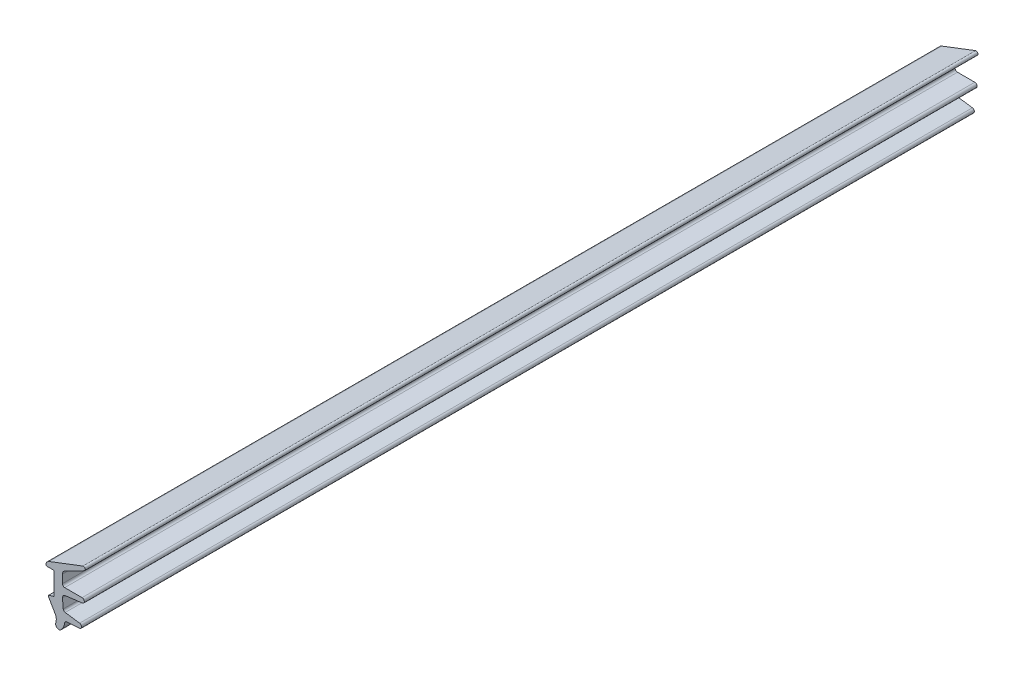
ISO-10303-21;
HEADER;
FILE_DESCRIPTION(('STEP AP214'),'2;1');
FILE_NAME('part.step','',(''),(''),'','','');
FILE_SCHEMA(('AUTOMOTIVE_DESIGN { 1 0 10303 214 1 1 1 1 }'));
ENDSEC;
DATA;
#1=APPLICATION_CONTEXT('core data for automotive mechanical design processes');
#2=APPLICATION_PROTOCOL_DEFINITION('international standard','automotive_design',2000,#1);
#3=PRODUCT_CONTEXT('',#1,'mechanical');
#4=PRODUCT('Part','Part','',(#3));
#5=PRODUCT_RELATED_PRODUCT_CATEGORY('part','',(#4));
#6=PRODUCT_DEFINITION_FORMATION('','',#4);
#7=PRODUCT_DEFINITION_CONTEXT('part definition',#1,'design');
#8=PRODUCT_DEFINITION('design','',#6,#7);
#9=PRODUCT_DEFINITION_SHAPE('','',#8);
#10=(LENGTH_UNIT() NAMED_UNIT(*) SI_UNIT(.MILLI.,.METRE.));
#11=(NAMED_UNIT(*) PLANE_ANGLE_UNIT() SI_UNIT($,.RADIAN.));
#12=(NAMED_UNIT(*) SI_UNIT($,.STERADIAN.) SOLID_ANGLE_UNIT());
#13=UNCERTAINTY_MEASURE_WITH_UNIT(LENGTH_MEASURE(1.E-05),#10,'distance_accuracy_value','');
#14=(GEOMETRIC_REPRESENTATION_CONTEXT(3) GLOBAL_UNCERTAINTY_ASSIGNED_CONTEXT((#13)) GLOBAL_UNIT_ASSIGNED_CONTEXT((#10,
#11,#12)) REPRESENTATION_CONTEXT('',''));
#15=CARTESIAN_POINT('',(0.,0.,0.));
#16=DIRECTION('',(0.,0.,1.));
#17=DIRECTION('',(1.,0.,0.));
#18=AXIS2_PLACEMENT_3D('',#15,#16,#17);
#19=CARTESIAN_POINT('',(-1.15176380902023,-5.26207958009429,0.));
#20=DIRECTION('',(-0.258819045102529,0.965925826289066,0.));
#21=DIRECTION('',(-0.965925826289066,-0.258819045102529,0.));
#22=AXIS2_PLACEMENT_3D('',#19,#20,#21);
#23=PLANE('',#22);
#24=DIRECTION('',(-0.965925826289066,-0.258819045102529,0.));
#25=VECTOR('',#24,1.);
#26=CARTESIAN_POINT('',(-1.15176380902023,-5.26207958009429,-97.75));
#27=LINE('',#26,#25);
#28=CARTESIAN_POINT('',(-0.148236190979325,-4.99318516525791,-97.75));
#29=VERTEX_POINT('',#28);
#30=CARTESIAN_POINT('',(-1.15176380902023,-5.2620795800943,-97.75));
#31=VERTEX_POINT('',#30);
#32=EDGE_CURVE('E214',#29,#31,#27,.T.);
#33=ORIENTED_EDGE('',*,*,#32,.T.);
#34=DIRECTION('',(0.,0.,1.));
#35=VECTOR('',#34,1.);
#36=CARTESIAN_POINT('',(-1.15176380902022,-5.26207958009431,0.));
#37=LINE('',#36,#35);
#38=CARTESIAN_POINT('',(-1.15176380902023,-5.2620795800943,97.75));
#39=VERTEX_POINT('',#38);
#40=EDGE_CURVE('E351',#39,#31,#37,.F.);
#41=ORIENTED_EDGE('',*,*,#40,.F.);
#42=DIRECTION('',(-0.965925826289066,-0.258819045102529,0.));
#43=VECTOR('',#42,1.);
#44=CARTESIAN_POINT('',(-1.15176380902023,-5.26207958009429,97.75));
#45=LINE('',#44,#43);
#46=CARTESIAN_POINT('',(-0.148236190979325,-4.99318516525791,97.75));
#47=VERTEX_POINT('',#46);
#48=EDGE_CURVE('E357',#39,#47,#45,.F.);
#49=ORIENTED_EDGE('',*,*,#48,.T.);
#50=DIRECTION('',(0.,0.,1.));
#51=VECTOR('',#50,1.);
#52=CARTESIAN_POINT('',(-0.148236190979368,-4.99318516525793,0.));
#53=LINE('',#52,#51);
#54=EDGE_CURVE('E359',#47,#29,#53,.F.);
#55=ORIENTED_EDGE('',*,*,#54,.T.);
#56=EDGE_LOOP('',(#33,#41,#49,#55));
#57=FACE_BOUND('',#56,.T.);
#58=ADVANCED_FACE('F15',(#57),#23,.T.);
#59=CARTESIAN_POINT('',(-0.19999999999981,-0.200000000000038,0.));
#60=DIRECTION('',(0.,0.,1.));
#61=DIRECTION('',(1.,0.,0.));
#62=AXIS2_PLACEMENT_3D('',#59,#60,#61);
#63=CYLINDRICAL_SURFACE('',#62,0.199999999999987);
#64=DIRECTION('',(0.,0.,-1.));
#65=VECTOR('',#64,1.);
#66=CARTESIAN_POINT('',(-0.19999999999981,0.,0.));
#67=LINE('',#66,#65);
#68=CARTESIAN_POINT('',(-0.19999999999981,0.,-97.75));
#69=VERTEX_POINT('',#68);
#70=CARTESIAN_POINT('',(-0.19999999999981,0.,97.75));
#71=VERTEX_POINT('',#70);
#72=EDGE_CURVE('E210',#69,#71,#67,.F.);
#73=ORIENTED_EDGE('',*,*,#72,.F.);
#74=CARTESIAN_POINT('',(-0.19999999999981,-0.200000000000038,-97.75));
#75=DIRECTION('',(0.,0.,1.));
#76=DIRECTION('',(1.,0.,0.));
#77=AXIS2_PLACEMENT_3D('',#74,#75,#76);
#78=CIRCLE('',#77,0.199999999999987);
#79=CARTESIAN_POINT('',(1.95047970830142E-13,-0.200000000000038,-97.75));
#80=VERTEX_POINT('',#79);
#81=EDGE_CURVE('E18',#80,#69,#78,.T.);
#82=ORIENTED_EDGE('',*,*,#81,.F.);
#83=DIRECTION('',(0.,0.,1.));
#84=VECTOR('',#83,1.);
#85=CARTESIAN_POINT('',(2.036238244E-13,-0.200000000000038,0.));
#86=LINE('',#85,#84);
#87=CARTESIAN_POINT('',(1.95047970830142E-13,-0.200000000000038,97.75));
#88=VERTEX_POINT('',#87);
#89=EDGE_CURVE('E207',#88,#80,#86,.F.);
#90=ORIENTED_EDGE('',*,*,#89,.F.);
#91=CARTESIAN_POINT('',(-0.19999999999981,-0.200000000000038,97.75));
#92=DIRECTION('',(0.,0.,1.));
#93=DIRECTION('',(1.,0.,0.));
#94=AXIS2_PLACEMENT_3D('',#91,#92,#93);
#95=CIRCLE('',#94,0.199999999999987);
#96=EDGE_CURVE('E213',#71,#88,#95,.F.);
#97=ORIENTED_EDGE('',*,*,#96,.F.);
#98=EDGE_LOOP('',(#73,#82,#90,#97));
#99=FACE_BOUND('',#98,.T.);
#100=ADVANCED_FACE('F205',(#99),#63,.F.);
#101=CARTESIAN_POINT('',(-0.199999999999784,-4.80000000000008,0.));
#102=DIRECTION('',(0.,0.,1.));
#103=DIRECTION('',(1.,0.,0.));
#104=AXIS2_PLACEMENT_3D('',#101,#102,#103);
#105=CYLINDRICAL_SURFACE('',#104,0.200000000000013);
#106=DIRECTION('',(0.,0.,1.));
#107=VECTOR('',#106,1.);
#108=CARTESIAN_POINT('',(2.036238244E-13,-4.80000000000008,0.));
#109=LINE('',#108,#107);
#110=CARTESIAN_POINT('',(1.95047970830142E-13,-4.80000000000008,-97.75));
#111=VERTEX_POINT('',#110);
#112=CARTESIAN_POINT('',(1.95047970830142E-13,-4.80000000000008,97.75));
#113=VERTEX_POINT('',#112);
#114=EDGE_CURVE('E222',#111,#113,#109,.T.);
#115=ORIENTED_EDGE('',*,*,#114,.F.);
#116=CARTESIAN_POINT('',(-0.199999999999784,-4.80000000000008,-97.75));
#117=DIRECTION('',(0.,0.,1.));
#118=DIRECTION('',(1.,0.,0.));
#119=AXIS2_PLACEMENT_3D('',#116,#117,#118);
#120=CIRCLE('',#119,0.200000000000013);
#121=EDGE_CURVE('E226',#29,#111,#120,.T.);
#122=ORIENTED_EDGE('',*,*,#121,.F.);
#123=ORIENTED_EDGE('',*,*,#54,.F.);
#124=CARTESIAN_POINT('',(-0.199999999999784,-4.80000000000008,97.75));
#125=DIRECTION('',(0.,0.,1.));
#126=DIRECTION('',(1.,0.,0.));
#127=AXIS2_PLACEMENT_3D('',#124,#125,#126);
#128=CIRCLE('',#127,0.200000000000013);
#129=EDGE_CURVE('E417',#113,#47,#128,.F.);
#130=ORIENTED_EDGE('',*,*,#129,.F.);
#131=EDGE_LOOP('',(#115,#122,#123,#130));
#132=FACE_BOUND('',#131,.T.);
#133=ADVANCED_FACE('F502',(#132),#105,.F.);
#134=CARTESIAN_POINT('',(-1.09999999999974,-5.45526474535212,0.));
#135=DIRECTION('',(0.,0.,1.));
#136=DIRECTION('',(1.,0.,0.));
#137=AXIS2_PLACEMENT_3D('',#134,#135,#136);
#138=CYLINDRICAL_SURFACE('',#137,0.199999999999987);
#139=CARTESIAN_POINT('',(-1.09999999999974,-5.45526474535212,-97.75));
#140=DIRECTION('',(0.,0.,1.));
#141=DIRECTION('',(1.,0.,0.));
#142=AXIS2_PLACEMENT_3D('',#139,#140,#141);
#143=CIRCLE('',#142,0.199999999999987);
#144=CARTESIAN_POINT('',(-1.27320508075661,-5.55526474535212,-97.75));
#145=VERTEX_POINT('',#144);
#146=EDGE_CURVE('E354',#31,#145,#143,.T.);
#147=ORIENTED_EDGE('',*,*,#146,.T.);
#148=DIRECTION('',(0.,0.,1.));
#149=VECTOR('',#148,1.);
#150=CARTESIAN_POINT('',(-1.27320508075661,-5.55526474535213,0.));
#151=LINE('',#150,#149);
#152=CARTESIAN_POINT('',(-1.27320508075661,-5.55526474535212,97.75));
#153=VERTEX_POINT('',#152);
#154=EDGE_CURVE('E329',#153,#145,#151,.F.);
#155=ORIENTED_EDGE('',*,*,#154,.F.);
#156=CARTESIAN_POINT('',(-1.09999999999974,-5.45526474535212,97.75));
#157=DIRECTION('',(0.,0.,1.));
#158=DIRECTION('',(1.,0.,0.));
#159=AXIS2_PLACEMENT_3D('',#156,#157,#158);
#160=CIRCLE('',#159,0.199999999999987);
#161=EDGE_CURVE('E355',#153,#39,#160,.F.);
#162=ORIENTED_EDGE('',*,*,#161,.T.);
#163=ORIENTED_EDGE('',*,*,#40,.T.);
#164=EDGE_LOOP('',(#147,#155,#162,#163));
#165=FACE_BOUND('',#164,.T.);
#166=ADVANCED_FACE('F497',(#165),#138,.T.);
#167=CARTESIAN_POINT('',(-1.54837324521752,-9.07865950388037,0.));
#168=DIRECTION('',(0.,0.,1.));
#169=DIRECTION('',(1.,0.,0.));
#170=AXIS2_PLACEMENT_3D('',#167,#168,#169);
#171=CYLINDRICAL_SURFACE('',#170,2.);
#172=DIRECTION('',(0.,0.,1.));
#173=VECTOR('',#172,1.);
#174=CARTESIAN_POINT('',(0.183677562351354,-8.07865950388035,0.));
#175=LINE('',#174,#173);
#176=CARTESIAN_POINT('',(0.183677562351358,-8.07865950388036,-97.75));
#177=VERTEX_POINT('',#176);
#178=CARTESIAN_POINT('',(0.183677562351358,-8.07865950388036,97.75));
#179=VERTEX_POINT('',#178);
#180=EDGE_CURVE('E328',#177,#179,#175,.T.);
#181=ORIENTED_EDGE('',*,*,#180,.F.);
#182=CARTESIAN_POINT('',(-1.54837324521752,-9.07865950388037,-97.75));
#183=DIRECTION('',(0.,0.,1.));
#184=DIRECTION('',(1.,0.,0.));
#185=AXIS2_PLACEMENT_3D('',#182,#183,#184);
#186=CIRCLE('',#185,2.);
#187=CARTESIAN_POINT('',(0.383478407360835,-9.59629759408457,-97.7500000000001));
#188=VERTEX_POINT('',#187);
#189=EDGE_CURVE('E412',#188,#177,#186,.T.);
#190=ORIENTED_EDGE('',*,*,#189,.F.);
#191=DIRECTION('',(0.,0.,1.));
#192=VECTOR('',#191,1.);
#193=CARTESIAN_POINT('',(0.383478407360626,-9.59629759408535,0.));
#194=LINE('',#193,#192);
#195=CARTESIAN_POINT('',(0.383478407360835,-9.59629759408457,97.75));
#196=VERTEX_POINT('',#195);
#197=EDGE_CURVE('E343',#196,#188,#194,.F.);
#198=ORIENTED_EDGE('',*,*,#197,.F.);
#199=CARTESIAN_POINT('',(-1.54837324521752,-9.07865950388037,97.75));
#200=DIRECTION('',(0.,0.,1.));
#201=DIRECTION('',(1.,0.,0.));
#202=AXIS2_PLACEMENT_3D('',#199,#200,#201);
#203=CIRCLE('',#202,2.);
#204=EDGE_CURVE('E344',#179,#196,#203,.F.);
#205=ORIENTED_EDGE('',*,*,#204,.F.);
#206=EDGE_LOOP('',(#181,#190,#198,#205));
#207=FACE_BOUND('',#206,.T.);
#208=ADVANCED_FACE('F489',(#207),#171,.F.);
#209=CARTESIAN_POINT('',(0.323851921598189,-9.81882666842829,0.));
#210=DIRECTION('',(-0.965925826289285,0.258819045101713,0.));
#211=DIRECTION('',(-0.258819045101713,-0.965925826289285,0.));
#212=AXIS2_PLACEMENT_3D('',#209,#210,#211);
#213=PLANE('',#212);
#214=DIRECTION('',(-0.258819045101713,-0.965925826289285,0.));
#215=VECTOR('',#214,1.);
#216=CARTESIAN_POINT('',(0.323851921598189,-9.81882666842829,-97.7500000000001));
#217=LINE('',#216,#215);
#218=CARTESIAN_POINT('',(0.323851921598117,-9.81882666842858,-97.75));
#219=VERTEX_POINT('',#218);
#220=EDGE_CURVE('E345',#188,#219,#217,.T.);
#221=ORIENTED_EDGE('',*,*,#220,.T.);
#222=DIRECTION('',(0.,0.,1.));
#223=VECTOR('',#222,1.);
#224=CARTESIAN_POINT('',(0.323851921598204,-9.8188266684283,0.));
#225=LINE('',#224,#223);
#226=CARTESIAN_POINT('',(0.323851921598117,-9.81882666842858,97.75));
#227=VERTEX_POINT('',#226);
#228=EDGE_CURVE('E323',#227,#219,#225,.F.);
#229=ORIENTED_EDGE('',*,*,#228,.F.);
#230=DIRECTION('',(-0.258819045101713,-0.965925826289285,0.));
#231=VECTOR('',#230,1.);
#232=CARTESIAN_POINT('',(0.323851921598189,-9.81882666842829,97.7500000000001));
#233=LINE('',#232,#231);
#234=EDGE_CURVE('E340',#227,#196,#233,.F.);
#235=ORIENTED_EDGE('',*,*,#234,.T.);
#236=ORIENTED_EDGE('',*,*,#197,.T.);
#237=EDGE_LOOP('',(#221,#229,#235,#236));
#238=FACE_BOUND('',#237,.T.);
#239=ADVANCED_FACE('F485',(#238),#213,.T.);
#240=CARTESIAN_POINT('',(2.77918139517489,-8.86828108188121,0.));
#241=DIRECTION('',(0.,0.,1.));
#242=DIRECTION('',(1.,0.,0.));
#243=AXIS2_PLACEMENT_3D('',#240,#241,#242);
#244=CYLINDRICAL_SURFACE('',#243,0.500000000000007);
#245=DIRECTION('',(0.,0.,1.));
#246=VECTOR('',#245,1.);
#247=CARTESIAN_POINT('',(2.28240305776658,-8.81161289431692,0.));
#248=LINE('',#247,#246);
#249=CARTESIAN_POINT('',(2.28240305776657,-8.81161289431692,-97.75));
#250=VERTEX_POINT('',#249);
#251=CARTESIAN_POINT('',(2.28240305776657,-8.81161289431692,97.75));
#252=VERTEX_POINT('',#251);
#253=EDGE_CURVE('E317',#250,#252,#248,.T.);
#254=ORIENTED_EDGE('',*,*,#253,.F.);
#255=CARTESIAN_POINT('',(2.77918139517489,-8.86828108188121,-97.75));
#256=DIRECTION('',(0.,0.,1.));
#257=DIRECTION('',(1.,0.,0.));
#258=AXIS2_PLACEMENT_3D('',#255,#256,#257);
#259=CIRCLE('',#258,0.500000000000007);
#260=CARTESIAN_POINT('',(2.74865712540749,-8.36921368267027,-97.75));
#261=VERTEX_POINT('',#260);
#262=EDGE_CURVE('E347',#261,#250,#259,.T.);
#263=ORIENTED_EDGE('',*,*,#262,.F.);
#264=DIRECTION('',(0.,0.,1.));
#265=VECTOR('',#264,1.);
#266=CARTESIAN_POINT('',(2.7486571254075,-8.36921368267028,0.));
#267=LINE('',#266,#265);
#268=CARTESIAN_POINT('',(2.74865712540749,-8.36921368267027,97.75));
#269=VERTEX_POINT('',#268);
#270=EDGE_CURVE('E314',#269,#261,#267,.F.);
#271=ORIENTED_EDGE('',*,*,#270,.F.);
#272=CARTESIAN_POINT('',(2.77918139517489,-8.86828108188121,97.75));
#273=DIRECTION('',(0.,0.,1.));
#274=DIRECTION('',(1.,0.,0.));
#275=AXIS2_PLACEMENT_3D('',#272,#273,#274);
#276=CIRCLE('',#275,0.500000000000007);
#277=EDGE_CURVE('E408',#252,#269,#276,.F.);
#278=ORIENTED_EDGE('',*,*,#277,.F.);
#279=EDGE_LOOP('',(#254,#263,#271,#278));
#280=FACE_BOUND('',#279,.T.);
#281=ADVANCED_FACE('F475',(#280),#244,.F.);
#282=CARTESIAN_POINT('',(5.5000000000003,-7.69999999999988,0.));
#283=DIRECTION('',(0.,0.,1.));
#284=DIRECTION('',(1.,0.,0.));
#285=AXIS2_PLACEMENT_3D('',#282,#283,#284);
#286=CYLINDRICAL_SURFACE('',#285,0.500000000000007);
#287=CARTESIAN_POINT('',(5.5000000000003,-7.69999999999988,-97.75));
#288=DIRECTION('',(0.,0.,1.));
#289=DIRECTION('',(1.,0.,0.));
#290=AXIS2_PLACEMENT_3D('',#287,#288,#289);
#291=CIRCLE('',#290,0.500000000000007);
#292=CARTESIAN_POINT('',(5.53052426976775,-8.19906739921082,-97.75));
#293=VERTEX_POINT('',#292);
#294=CARTESIAN_POINT('',(5.56958655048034,-7.20486596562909,-97.75));
#295=VERTEX_POINT('',#294);
#296=EDGE_CURVE('E404',#293,#295,#291,.T.);
#297=ORIENTED_EDGE('',*,*,#296,.T.);
#298=DIRECTION('',(0.,0.,1.));
#299=VECTOR('',#298,1.);
#300=CARTESIAN_POINT('',(5.56958655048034,-7.2048659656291,0.));
#301=LINE('',#300,#299);
#302=CARTESIAN_POINT('',(5.56958655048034,-7.20486596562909,97.75));
#303=VERTEX_POINT('',#302);
#304=EDGE_CURVE('E308',#303,#295,#301,.F.);
#305=ORIENTED_EDGE('',*,*,#304,.F.);
#306=CARTESIAN_POINT('',(5.5000000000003,-7.69999999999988,97.75));
#307=DIRECTION('',(0.,0.,1.));
#308=DIRECTION('',(1.,0.,0.));
#309=AXIS2_PLACEMENT_3D('',#306,#307,#308);
#310=CIRCLE('',#309,0.500000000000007);
#311=CARTESIAN_POINT('',(5.53052426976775,-8.19906739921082,97.75));
#312=VERTEX_POINT('',#311);
#313=EDGE_CURVE('E406',#303,#312,#310,.F.);
#314=ORIENTED_EDGE('',*,*,#313,.T.);
#315=DIRECTION('',(0.,0.,1.));
#316=VECTOR('',#315,1.);
#317=CARTESIAN_POINT('',(5.53052426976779,-8.19906739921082,0.));
#318=LINE('',#317,#316);
#319=EDGE_CURVE('E311',#293,#312,#318,.T.);
#320=ORIENTED_EDGE('',*,*,#319,.F.);
#321=EDGE_LOOP('',(#297,#305,#314,#320));
#322=FACE_BOUND('',#321,.T.);
#323=ADVANCED_FACE('F471',(#322),#286,.T.);
#324=CARTESIAN_POINT('',(2.47544367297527,-6.26509875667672,0.));
#325=DIRECTION('',(0.,0.,1.));
#326=DIRECTION('',(1.,0.,0.));
#327=AXIS2_PLACEMENT_3D('',#324,#325,#326);
#328=CYLINDRICAL_SURFACE('',#327,0.500000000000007);
#329=DIRECTION('',(0.,0.,1.));
#330=VECTOR('',#329,1.);
#331=CARTESIAN_POINT('',(2.40585712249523,-6.76023279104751,0.));
#332=LINE('',#331,#330);
#333=CARTESIAN_POINT('',(2.40585712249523,-6.76023279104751,-97.75));
#334=VERTEX_POINT('',#333);
#335=CARTESIAN_POINT('',(2.40585712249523,-6.76023279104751,97.75));
#336=VERTEX_POINT('',#335);
#337=EDGE_CURVE('E305',#334,#336,#332,.T.);
#338=ORIENTED_EDGE('',*,*,#337,.F.);
#339=CARTESIAN_POINT('',(2.47544367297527,-6.26509875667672,-97.75));
#340=DIRECTION('',(0.,0.,1.));
#341=DIRECTION('',(1.,0.,0.));
#342=AXIS2_PLACEMENT_3D('',#339,#340,#341);
#343=CIRCLE('',#342,0.500000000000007);
#344=CARTESIAN_POINT('',(1.9773463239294,-6.30867662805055,-97.75));
#345=VERTEX_POINT('',#344);
#346=EDGE_CURVE('E402',#345,#334,#343,.T.);
#347=ORIENTED_EDGE('',*,*,#346,.F.);
#348=DIRECTION('',(0.,0.,1.));
#349=VECTOR('',#348,1.);
#350=CARTESIAN_POINT('',(1.97734632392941,-6.30867662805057,0.));
#351=LINE('',#350,#349);
#352=CARTESIAN_POINT('',(1.9773463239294,-6.30867662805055,97.75));
#353=VERTEX_POINT('',#352);
#354=EDGE_CURVE('E302',#353,#345,#351,.F.);
#355=ORIENTED_EDGE('',*,*,#354,.F.);
#356=CARTESIAN_POINT('',(2.47544367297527,-6.26509875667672,97.75));
#357=DIRECTION('',(0.,0.,1.));
#358=DIRECTION('',(1.,0.,0.));
#359=AXIS2_PLACEMENT_3D('',#356,#357,#358);
#360=CIRCLE('',#359,0.500000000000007);
#361=EDGE_CURVE('E400',#336,#353,#360,.F.);
#362=ORIENTED_EDGE('',*,*,#361,.F.);
#363=EDGE_LOOP('',(#338,#347,#355,#362));
#364=FACE_BOUND('',#363,.T.);
#365=ADVANCED_FACE('F575',(#364),#328,.F.);
#366=CARTESIAN_POINT('',(2.50000000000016,-4.2510362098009,0.));
#367=DIRECTION('',(0.,0.,1.));
#368=DIRECTION('',(1.,0.,0.));
#369=AXIS2_PLACEMENT_3D('',#366,#367,#368);
#370=CYLINDRICAL_SURFACE('',#369,0.699999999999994);
#371=DIRECTION('',(0.,0.,1.));
#372=VECTOR('',#371,1.);
#373=CARTESIAN_POINT('',(1.80266371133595,-4.31204522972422,0.));
#374=LINE('',#373,#372);
#375=CARTESIAN_POINT('',(1.80266371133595,-4.31204522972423,-97.75));
#376=VERTEX_POINT('',#375);
#377=CARTESIAN_POINT('',(1.80266371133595,-4.31204522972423,97.75));
#378=VERTEX_POINT('',#377);
#379=EDGE_CURVE('E299',#376,#378,#374,.T.);
#380=ORIENTED_EDGE('',*,*,#379,.F.);
#381=CARTESIAN_POINT('',(2.50000000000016,-4.2510362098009,-97.75));
#382=DIRECTION('',(0.,0.,1.));
#383=DIRECTION('',(1.,0.,0.));
#384=AXIS2_PLACEMENT_3D('',#381,#382,#383);
#385=CIRCLE('',#384,0.699999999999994);
#386=CARTESIAN_POINT('',(2.41469145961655,-3.55625390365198,-97.75));
#387=VERTEX_POINT('',#386);
#388=EDGE_CURVE('E398',#387,#376,#385,.T.);
#389=ORIENTED_EDGE('',*,*,#388,.F.);
#390=DIRECTION('',(0.,0.,1.));
#391=VECTOR('',#390,1.);
#392=CARTESIAN_POINT('',(2.41469145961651,-3.55625390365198,0.));
#393=LINE('',#392,#391);
#394=CARTESIAN_POINT('',(2.41469145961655,-3.55625390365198,97.75));
#395=VERTEX_POINT('',#394);
#396=EDGE_CURVE('E296',#395,#387,#393,.F.);
#397=ORIENTED_EDGE('',*,*,#396,.F.);
#398=CARTESIAN_POINT('',(2.50000000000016,-4.2510362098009,97.75));
#399=DIRECTION('',(0.,0.,1.));
#400=DIRECTION('',(1.,0.,0.));
#401=AXIS2_PLACEMENT_3D('',#398,#399,#400);
#402=CIRCLE('',#401,0.699999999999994);
#403=EDGE_CURVE('E396',#378,#395,#402,.F.);
#404=ORIENTED_EDGE('',*,*,#403,.F.);
#405=EDGE_LOOP('',(#380,#389,#397,#404));
#406=FACE_BOUND('',#405,.T.);
#407=ADVANCED_FACE('F571',(#406),#370,.F.);
#408=CARTESIAN_POINT('',(6.10000000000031,-2.59999999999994,0.));
#409=DIRECTION('',(0.,0.,1.));
#410=DIRECTION('',(1.,0.,0.));
#411=AXIS2_PLACEMENT_3D('',#408,#409,#410);
#412=CYLINDRICAL_SURFACE('',#411,0.500000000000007);
#413=CARTESIAN_POINT('',(6.10000000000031,-2.59999999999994,-97.75));
#414=DIRECTION('',(0.,0.,1.));
#415=DIRECTION('',(1.,0.,0.));
#416=AXIS2_PLACEMENT_3D('',#413,#414,#415);
#417=CIRCLE('',#416,0.500000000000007);
#418=CARTESIAN_POINT('',(6.16093467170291,-3.09627307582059,-97.75));
#419=VERTEX_POINT('',#418);
#420=CARTESIAN_POINT('',(6.10000000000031,-2.09999999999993,-97.75));
#421=VERTEX_POINT('',#420);
#422=EDGE_CURVE('E392',#419,#421,#417,.T.);
#423=ORIENTED_EDGE('',*,*,#422,.T.);
#424=DIRECTION('',(0.,0.,1.));
#425=VECTOR('',#424,1.);
#426=CARTESIAN_POINT('',(6.10000000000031,-2.09999999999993,0.));
#427=LINE('',#426,#425);
#428=CARTESIAN_POINT('',(6.10000000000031,-2.09999999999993,97.75));
#429=VERTEX_POINT('',#428);
#430=EDGE_CURVE('E290',#429,#421,#427,.F.);
#431=ORIENTED_EDGE('',*,*,#430,.F.);
#432=CARTESIAN_POINT('',(6.10000000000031,-2.59999999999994,97.75));
#433=DIRECTION('',(0.,0.,1.));
#434=DIRECTION('',(1.,0.,0.));
#435=AXIS2_PLACEMENT_3D('',#432,#433,#434);
#436=CIRCLE('',#435,0.500000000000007);
#437=CARTESIAN_POINT('',(6.16093467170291,-3.09627307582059,97.75));
#438=VERTEX_POINT('',#437);
#439=EDGE_CURVE('E394',#429,#438,#436,.F.);
#440=ORIENTED_EDGE('',*,*,#439,.T.);
#441=DIRECTION('',(0.,0.,1.));
#442=VECTOR('',#441,1.);
#443=CARTESIAN_POINT('',(6.16093467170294,-3.09627307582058,0.));
#444=LINE('',#443,#442);
#445=EDGE_CURVE('E293',#419,#438,#444,.T.);
#446=ORIENTED_EDGE('',*,*,#445,.F.);
#447=EDGE_LOOP('',(#423,#431,#440,#446));
#448=FACE_BOUND('',#447,.T.);
#449=ADVANCED_FACE('F567',(#448),#412,.T.);
#450=CARTESIAN_POINT('',(2.30000000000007,-1.59999999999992,0.));
#451=DIRECTION('',(0.,0.,1.));
#452=DIRECTION('',(1.,0.,0.));
#453=AXIS2_PLACEMENT_3D('',#450,#451,#452);
#454=CYLINDRICAL_SURFACE('',#453,0.500000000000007);
#455=DIRECTION('',(0.,0.,1.));
#456=VECTOR('',#455,1.);
#457=CARTESIAN_POINT('',(2.30000000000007,-2.09999999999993,0.));
#458=LINE('',#457,#456);
#459=CARTESIAN_POINT('',(2.30000000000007,-2.09999999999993,-97.75));
#460=VERTEX_POINT('',#459);
#461=CARTESIAN_POINT('',(2.30000000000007,-2.09999999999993,97.75));
#462=VERTEX_POINT('',#461);
#463=EDGE_CURVE('E287',#460,#462,#458,.T.);
#464=ORIENTED_EDGE('',*,*,#463,.F.);
#465=CARTESIAN_POINT('',(2.30000000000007,-1.59999999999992,-97.75));
#466=DIRECTION('',(0.,0.,1.));
#467=DIRECTION('',(1.,0.,0.));
#468=AXIS2_PLACEMENT_3D('',#465,#466,#467);
#469=CIRCLE('',#468,0.500000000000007);
#470=CARTESIAN_POINT('',(1.80000000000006,-1.59999999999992,-97.75));
#471=VERTEX_POINT('',#470);
#472=EDGE_CURVE('E390',#471,#460,#469,.T.);
#473=ORIENTED_EDGE('',*,*,#472,.F.);
#474=DIRECTION('',(0.,0.,-1.));
#475=VECTOR('',#474,1.);
#476=CARTESIAN_POINT('',(1.80000000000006,-1.59999999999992,0.));
#477=LINE('',#476,#475);
#478=CARTESIAN_POINT('',(1.80000000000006,-1.59999999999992,97.75));
#479=VERTEX_POINT('',#478);
#480=EDGE_CURVE('E284',#479,#471,#477,.T.);
#481=ORIENTED_EDGE('',*,*,#480,.F.);
#482=CARTESIAN_POINT('',(2.30000000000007,-1.59999999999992,97.75));
#483=DIRECTION('',(0.,0.,1.));
#484=DIRECTION('',(1.,0.,0.));
#485=AXIS2_PLACEMENT_3D('',#482,#483,#484);
#486=CIRCLE('',#485,0.500000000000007);
#487=EDGE_CURVE('E388',#462,#479,#486,.F.);
#488=ORIENTED_EDGE('',*,*,#487,.F.);
#489=EDGE_LOOP('',(#464,#473,#481,#488));
#490=FACE_BOUND('',#489,.T.);
#491=ADVANCED_FACE('F563',(#490),#454,.F.);
#492=CARTESIAN_POINT('',(2.80000000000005,0.194451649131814,0.));
#493=DIRECTION('',(0.,0.,1.));
#494=DIRECTION('',(1.,0.,0.));
#495=AXIS2_PLACEMENT_3D('',#492,#493,#494);
#496=CYLINDRICAL_SURFACE('',#495,1.00000000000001);
#497=DIRECTION('',(0.,0.,-1.));
#498=VECTOR('',#497,1.);
#499=CARTESIAN_POINT('',(1.80000000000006,0.194451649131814,0.));
#500=LINE('',#499,#498);
#501=CARTESIAN_POINT('',(1.80000000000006,0.194451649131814,-97.75));
#502=VERTEX_POINT('',#501);
#503=CARTESIAN_POINT('',(1.80000000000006,0.194451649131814,97.75));
#504=VERTEX_POINT('',#503);
#505=EDGE_CURVE('E283',#502,#504,#500,.F.);
#506=ORIENTED_EDGE('',*,*,#505,.F.);
#507=CARTESIAN_POINT('',(2.80000000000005,0.194451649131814,-97.75));
#508=DIRECTION('',(0.,0.,1.));
#509=DIRECTION('',(1.,0.,0.));
#510=AXIS2_PLACEMENT_3D('',#507,#508,#509);
#511=CIRCLE('',#510,1.00000000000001);
#512=CARTESIAN_POINT('',(2.34600950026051,1.08545817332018,-97.75));
#513=VERTEX_POINT('',#512);
#514=EDGE_CURVE('E386',#513,#502,#511,.T.);
#515=ORIENTED_EDGE('',*,*,#514,.F.);
#516=DIRECTION('',(0.,0.,1.));
#517=VECTOR('',#516,1.);
#518=CARTESIAN_POINT('',(2.34600950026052,1.08545817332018,0.));
#519=LINE('',#518,#517);
#520=CARTESIAN_POINT('',(2.34600950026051,1.08545817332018,97.75));
#521=VERTEX_POINT('',#520);
#522=EDGE_CURVE('E279',#521,#513,#519,.F.);
#523=ORIENTED_EDGE('',*,*,#522,.F.);
#524=CARTESIAN_POINT('',(2.80000000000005,0.194451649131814,97.75));
#525=DIRECTION('',(0.,0.,1.));
#526=DIRECTION('',(1.,0.,0.));
#527=AXIS2_PLACEMENT_3D('',#524,#525,#526);
#528=CIRCLE('',#527,1.00000000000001);
#529=EDGE_CURVE('E339',#504,#521,#528,.F.);
#530=ORIENTED_EDGE('',*,*,#529,.F.);
#531=EDGE_LOOP('',(#506,#515,#523,#530));
#532=FACE_BOUND('',#531,.T.);
#533=ADVANCED_FACE('F560',(#532),#496,.F.);
#534=CARTESIAN_POINT('',(-0.19999999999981,0.,0.));
#535=DIRECTION('',(0.,-1.,0.));
#536=DIRECTION('',(0.,0.,-1.));
#537=AXIS2_PLACEMENT_3D('',#534,#535,#536);
#538=PLANE('',#537);
#539=DIRECTION('',(1.,0.,0.));
#540=VECTOR('',#539,1.);
#541=CARTESIAN_POINT('',(-0.19999999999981,0.,-97.75));
#542=LINE('',#541,#540);
#543=CARTESIAN_POINT('',(-1.59999999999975,0.,-97.75));
#544=VERTEX_POINT('',#543);
#545=EDGE_CURVE('E335',#544,#69,#542,.T.);
#546=ORIENTED_EDGE('',*,*,#545,.T.);
#547=ORIENTED_EDGE('',*,*,#72,.T.);
#548=DIRECTION('',(1.,0.,0.));
#549=VECTOR('',#548,1.);
#550=CARTESIAN_POINT('',(-0.19999999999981,0.,97.75));
#551=LINE('',#550,#549);
#552=CARTESIAN_POINT('',(-1.59999999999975,0.,97.75));
#553=VERTEX_POINT('',#552);
#554=EDGE_CURVE('E337',#71,#553,#551,.F.);
#555=ORIENTED_EDGE('',*,*,#554,.T.);
#556=DIRECTION('',(0.,0.,1.));
#557=VECTOR('',#556,1.);
#558=CARTESIAN_POINT('',(-1.59999999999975,0.,0.));
#559=LINE('',#558,#557);
#560=EDGE_CURVE('E277',#544,#553,#559,.T.);
#561=ORIENTED_EDGE('',*,*,#560,.F.);
#562=EDGE_LOOP('',(#546,#547,#555,#561));
#563=FACE_BOUND('',#562,.T.);
#564=ADVANCED_FACE('F423',(#563),#538,.T.);
#565=CARTESIAN_POINT('',(2.036238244E-13,-4.80000000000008,0.));
#566=DIRECTION('',(-1.,0.,0.));
#567=DIRECTION('',(0.,0.,1.));
#568=AXIS2_PLACEMENT_3D('',#565,#566,#567);
#569=PLANE('',#568);
#570=DIRECTION('',(0.,1.,0.));
#571=VECTOR('',#570,1.);
#572=CARTESIAN_POINT('',(1.86482773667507E-13,-2.93552070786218,-97.75));
#573=LINE('',#572,#571);
#574=EDGE_CURVE('E219',#80,#111,#573,.F.);
#575=ORIENTED_EDGE('',*,*,#574,.T.);
#576=ORIENTED_EDGE('',*,*,#114,.T.);
#577=DIRECTION('',(0.,1.,0.));
#578=VECTOR('',#577,1.);
#579=CARTESIAN_POINT('',(1.86482773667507E-13,-2.93552070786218,97.75));
#580=LINE('',#579,#578);
#581=EDGE_CURVE('E221',#88,#113,#580,.F.);
#582=ORIENTED_EDGE('',*,*,#581,.F.);
#583=ORIENTED_EDGE('',*,*,#89,.T.);
#584=EDGE_LOOP('',(#575,#576,#582,#583));
#585=FACE_BOUND('',#584,.T.);
#586=ADVANCED_FACE('F217',(#585),#569,.T.);
#587=CARTESIAN_POINT('',(0.183677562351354,-8.07865950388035,0.));
#588=DIRECTION('',(-0.866025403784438,-0.500000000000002,0.));
#589=DIRECTION('',(0.500000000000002,-0.866025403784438,0.));
#590=AXIS2_PLACEMENT_3D('',#587,#588,#589);
#591=PLANE('',#590);
#592=DIRECTION('',(0.499999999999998,-0.86602540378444,0.));
#593=VECTOR('',#592,1.);
#594=CARTESIAN_POINT('',(-1.2732050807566,-5.55526474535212,-97.75));
#595=LINE('',#594,#593);
#596=EDGE_CURVE('E228',#145,#177,#595,.T.);
#597=ORIENTED_EDGE('',*,*,#596,.T.);
#598=ORIENTED_EDGE('',*,*,#180,.T.);
#599=DIRECTION('',(0.499999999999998,-0.86602540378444,0.));
#600=VECTOR('',#599,1.);
#601=CARTESIAN_POINT('',(-1.2732050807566,-5.55526474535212,97.75));
#602=LINE('',#601,#600);
#603=EDGE_CURVE('E269',#153,#179,#602,.T.);
#604=ORIENTED_EDGE('',*,*,#603,.F.);
#605=ORIENTED_EDGE('',*,*,#154,.T.);
#606=EDGE_LOOP('',(#597,#598,#604,#605));
#607=FACE_BOUND('',#606,.T.);
#608=ADVANCED_FACE('F493',(#607),#591,.T.);
#609=CARTESIAN_POINT('',(1.00000000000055,-10.0000000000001,0.));
#610=DIRECTION('',(0.,0.,1.));
#611=DIRECTION('',(1.,0.,0.));
#612=AXIS2_PLACEMENT_3D('',#609,#610,#611);
#613=CYLINDRICAL_SURFACE('',#612,0.699999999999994);
#614=CARTESIAN_POINT('',(1.00000000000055,-10.0000000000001,-97.75));
#615=DIRECTION('',(0.,0.,1.));
#616=DIRECTION('',(1.,0.,0.));
#617=AXIS2_PLACEMENT_3D('',#614,#615,#616);
#618=CIRCLE('',#617,0.699999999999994);
#619=CARTESIAN_POINT('',(1.52511090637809,-10.4628806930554,-97.75));
#620=VERTEX_POINT('',#619);
#621=EDGE_CURVE('E232',#219,#620,#618,.T.);
#622=ORIENTED_EDGE('',*,*,#621,.T.);
#623=DIRECTION('',(0.,0.,1.));
#624=VECTOR('',#623,1.);
#625=CARTESIAN_POINT('',(1.52511090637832,-10.4628806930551,0.));
#626=LINE('',#625,#624);
#627=CARTESIAN_POINT('',(1.5251109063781,-10.4628806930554,97.75));
#628=VERTEX_POINT('',#627);
#629=EDGE_CURVE('E320',#628,#620,#626,.F.);
#630=ORIENTED_EDGE('',*,*,#629,.F.);
#631=CARTESIAN_POINT('',(1.00000000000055,-10.0000000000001,97.75));
#632=DIRECTION('',(0.,0.,1.));
#633=DIRECTION('',(1.,0.,0.));
#634=AXIS2_PLACEMENT_3D('',#631,#632,#633);
#635=CIRCLE('',#634,0.699999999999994);
#636=EDGE_CURVE('E272',#227,#628,#635,.T.);
#637=ORIENTED_EDGE('',*,*,#636,.F.);
#638=ORIENTED_EDGE('',*,*,#228,.T.);
#639=EDGE_LOOP('',(#622,#630,#637,#638));
#640=FACE_BOUND('',#639,.T.);
#641=ADVANCED_FACE('F481',(#640),#613,.T.);
#642=CARTESIAN_POINT('',(-0.617934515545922,-8.48076740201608,0.));
#643=DIRECTION('',(0.,0.,1.));
#644=DIRECTION('',(1.,0.,0.));
#645=AXIS2_PLACEMENT_3D('',#642,#643,#644);
#646=CYLINDRICAL_SURFACE('',#645,2.91914658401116);
#647=CARTESIAN_POINT('',(-0.617934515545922,-8.48076740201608,-97.75));
#648=DIRECTION('',(0.,0.,1.));
#649=DIRECTION('',(1.,0.,0.));
#650=AXIS2_PLACEMENT_3D('',#647,#648,#649);
#651=CIRCLE('',#650,2.91914658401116);
#652=EDGE_CURVE('E372',#620,#250,#651,.T.);
#653=ORIENTED_EDGE('',*,*,#652,.T.);
#654=ORIENTED_EDGE('',*,*,#253,.T.);
#655=CARTESIAN_POINT('',(-0.617934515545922,-8.48076740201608,97.75));
#656=DIRECTION('',(0.,0.,1.));
#657=DIRECTION('',(1.,0.,0.));
#658=AXIS2_PLACEMENT_3D('',#655,#656,#657);
#659=CIRCLE('',#658,2.91914658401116);
#660=EDGE_CURVE('E268',#628,#252,#659,.T.);
#661=ORIENTED_EDGE('',*,*,#660,.F.);
#662=ORIENTED_EDGE('',*,*,#629,.T.);
#663=EDGE_LOOP('',(#653,#654,#661,#662));
#664=FACE_BOUND('',#663,.T.);
#665=ADVANCED_FACE('F477',(#664),#646,.T.);
#666=CARTESIAN_POINT('',(5.53052426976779,-8.19906739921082,0.));
#667=DIRECTION('',(0.061048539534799,-0.99813479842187,0.));
#668=DIRECTION('',(0.99813479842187,0.061048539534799,0.));
#669=AXIS2_PLACEMENT_3D('',#666,#667,#668);
#670=PLANE('',#669);
#671=DIRECTION('',(0.99813479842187,0.061048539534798,0.));
#672=VECTOR('',#671,1.);
#673=CARTESIAN_POINT('',(2.7486571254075,-8.36921368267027,-97.75));
#674=LINE('',#673,#672);
#675=EDGE_CURVE('E375',#261,#293,#674,.T.);
#676=ORIENTED_EDGE('',*,*,#675,.T.);
#677=ORIENTED_EDGE('',*,*,#319,.T.);
#678=DIRECTION('',(0.99813479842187,0.061048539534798,0.));
#679=VECTOR('',#678,1.);
#680=CARTESIAN_POINT('',(2.7486571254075,-8.36921368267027,97.75));
#681=LINE('',#680,#679);
#682=EDGE_CURVE('E265',#269,#312,#681,.T.);
#683=ORIENTED_EDGE('',*,*,#682,.F.);
#684=ORIENTED_EDGE('',*,*,#270,.T.);
#685=EDGE_LOOP('',(#676,#677,#683,#684));
#686=FACE_BOUND('',#685,.T.);
#687=ADVANCED_FACE('F462',(#686),#670,.T.);
#688=CARTESIAN_POINT('',(2.40585712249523,-6.76023279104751,0.));
#689=DIRECTION('',(0.139173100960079,0.990268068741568,0.));
#690=DIRECTION('',(-0.990268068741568,0.139173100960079,0.));
#691=AXIS2_PLACEMENT_3D('',#688,#689,#690);
#692=PLANE('',#691);
#693=DIRECTION('',(-0.990268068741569,0.139173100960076,0.));
#694=VECTOR('',#693,1.);
#695=CARTESIAN_POINT('',(5.56958655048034,-7.20486596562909,-97.75));
#696=LINE('',#695,#694);
#697=EDGE_CURVE('E457',#295,#334,#696,.T.);
#698=ORIENTED_EDGE('',*,*,#697,.T.);
#699=ORIENTED_EDGE('',*,*,#337,.T.);
#700=DIRECTION('',(-0.990268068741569,0.139173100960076,0.));
#701=VECTOR('',#700,1.);
#702=CARTESIAN_POINT('',(5.56958655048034,-7.20486596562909,97.75));
#703=LINE('',#702,#701);
#704=EDGE_CURVE('E262',#303,#336,#703,.T.);
#705=ORIENTED_EDGE('',*,*,#704,.F.);
#706=ORIENTED_EDGE('',*,*,#304,.T.);
#707=EDGE_LOOP('',(#698,#699,#705,#706));
#708=FACE_BOUND('',#707,.T.);
#709=ADVANCED_FACE('F543',(#708),#692,.T.);
#710=CARTESIAN_POINT('',(1.80266371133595,-4.31204522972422,0.));
#711=DIRECTION('',(0.996194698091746,0.08715574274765,0.));
#712=DIRECTION('',(-0.08715574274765,0.996194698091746,0.));
#713=AXIS2_PLACEMENT_3D('',#710,#711,#712);
#714=PLANE('',#713);
#715=DIRECTION('',(-0.0871557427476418,0.996194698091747,0.));
#716=VECTOR('',#715,1.);
#717=CARTESIAN_POINT('',(1.97734632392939,-6.30867662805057,-97.75));
#718=LINE('',#717,#716);
#719=EDGE_CURVE('E454',#345,#376,#718,.T.);
#720=ORIENTED_EDGE('',*,*,#719,.T.);
#721=ORIENTED_EDGE('',*,*,#379,.T.);
#722=DIRECTION('',(-0.0871557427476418,0.996194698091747,0.));
#723=VECTOR('',#722,1.);
#724=CARTESIAN_POINT('',(1.97734632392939,-6.30867662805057,97.75));
#725=LINE('',#724,#723);
#726=EDGE_CURVE('E259',#353,#378,#725,.T.);
#727=ORIENTED_EDGE('',*,*,#726,.F.);
#728=ORIENTED_EDGE('',*,*,#354,.T.);
#729=EDGE_LOOP('',(#720,#721,#727,#728));
#730=FACE_BOUND('',#729,.T.);
#731=ADVANCED_FACE('F539',(#730),#714,.T.);
#732=CARTESIAN_POINT('',(6.16093467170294,-3.09627307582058,0.));
#733=DIRECTION('',(0.121869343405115,-0.992546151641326,0.));
#734=DIRECTION('',(0.992546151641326,0.121869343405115,0.));
#735=AXIS2_PLACEMENT_3D('',#732,#733,#734);
#736=PLANE('',#735);
#737=DIRECTION('',(0.992546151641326,0.121869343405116,0.));
#738=VECTOR('',#737,1.);
#739=CARTESIAN_POINT('',(2.41469145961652,-3.55625390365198,-97.75));
#740=LINE('',#739,#738);
#741=EDGE_CURVE('E451',#387,#419,#740,.T.);
#742=ORIENTED_EDGE('',*,*,#741,.T.);
#743=ORIENTED_EDGE('',*,*,#445,.T.);
#744=DIRECTION('',(0.992546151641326,0.121869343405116,0.));
#745=VECTOR('',#744,1.);
#746=CARTESIAN_POINT('',(2.41469145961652,-3.55625390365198,97.75));
#747=LINE('',#746,#745);
#748=EDGE_CURVE('E256',#395,#438,#747,.T.);
#749=ORIENTED_EDGE('',*,*,#748,.F.);
#750=ORIENTED_EDGE('',*,*,#396,.T.);
#751=EDGE_LOOP('',(#742,#743,#749,#750));
#752=FACE_BOUND('',#751,.T.);
#753=ADVANCED_FACE('F535',(#752),#736,.T.);
#754=CARTESIAN_POINT('',(2.30000000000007,-2.09999999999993,0.));
#755=DIRECTION('',(0.,1.,0.));
#756=DIRECTION('',(0.,0.,1.));
#757=AXIS2_PLACEMENT_3D('',#754,#755,#756);
#758=PLANE('',#757);
#759=DIRECTION('',(1.,0.,0.));
#760=VECTOR('',#759,1.);
#761=CARTESIAN_POINT('',(2.46983416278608,-2.09999999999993,-97.75));
#762=LINE('',#761,#760);
#763=EDGE_CURVE('E446',#421,#460,#762,.F.);
#764=ORIENTED_EDGE('',*,*,#763,.T.);
#765=ORIENTED_EDGE('',*,*,#463,.T.);
#766=DIRECTION('',(1.,0.,0.));
#767=VECTOR('',#766,1.);
#768=CARTESIAN_POINT('',(2.46983416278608,-2.09999999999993,97.75));
#769=LINE('',#768,#767);
#770=EDGE_CURVE('E253',#429,#462,#769,.F.);
#771=ORIENTED_EDGE('',*,*,#770,.F.);
#772=ORIENTED_EDGE('',*,*,#430,.T.);
#773=EDGE_LOOP('',(#764,#765,#771,#772));
#774=FACE_BOUND('',#773,.T.);
#775=ADVANCED_FACE('F531',(#774),#758,.T.);
#776=CARTESIAN_POINT('',(1.80000000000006,0.194451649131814,0.));
#777=DIRECTION('',(1.,0.,0.));
#778=DIRECTION('',(0.,0.,-1.));
#779=AXIS2_PLACEMENT_3D('',#776,#777,#778);
#780=PLANE('',#779);
#781=DIRECTION('',(0.,1.,0.));
#782=VECTOR('',#781,1.);
#783=CARTESIAN_POINT('',(1.80000000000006,-2.93552070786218,-97.75));
#784=LINE('',#783,#782);
#785=EDGE_CURVE('E443',#471,#502,#784,.T.);
#786=ORIENTED_EDGE('',*,*,#785,.T.);
#787=ORIENTED_EDGE('',*,*,#505,.T.);
#788=DIRECTION('',(0.,1.,0.));
#789=VECTOR('',#788,1.);
#790=CARTESIAN_POINT('',(1.80000000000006,-2.93552070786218,97.75));
#791=LINE('',#790,#789);
#792=EDGE_CURVE('E250',#479,#504,#791,.T.);
#793=ORIENTED_EDGE('',*,*,#792,.F.);
#794=ORIENTED_EDGE('',*,*,#480,.T.);
#795=EDGE_LOOP('',(#786,#787,#793,#794));
#796=FACE_BOUND('',#795,.T.);
#797=ADVANCED_FACE('F528',(#796),#780,.T.);
#798=CARTESIAN_POINT('',(6.58159619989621,3.24359739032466,0.));
#799=DIRECTION('',(0.453990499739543,-0.89100652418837,0.));
#800=DIRECTION('',(0.89100652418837,0.453990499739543,0.));
#801=AXIS2_PLACEMENT_3D('',#798,#799,#800);
#802=PLANE('',#801);
#803=DIRECTION('',(0.89100652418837,0.453990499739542,0.));
#804=VECTOR('',#803,1.);
#805=CARTESIAN_POINT('',(2.34600950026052,1.08545817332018,-97.75));
#806=LINE('',#805,#804);
#807=CARTESIAN_POINT('',(6.58159619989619,3.24359739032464,-97.75));
#808=VERTEX_POINT('',#807);
#809=EDGE_CURVE('E371',#513,#808,#806,.T.);
#810=ORIENTED_EDGE('',*,*,#809,.T.);
#811=DIRECTION('',(0.,0.,1.));
#812=VECTOR('',#811,1.);
#813=CARTESIAN_POINT('',(6.58159619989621,3.24359739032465,0.));
#814=LINE('',#813,#812);
#815=CARTESIAN_POINT('',(6.58159619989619,3.24359739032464,97.75));
#816=VERTEX_POINT('',#815);
#817=EDGE_CURVE('E229',#816,#808,#814,.F.);
#818=ORIENTED_EDGE('',*,*,#817,.F.);
#819=DIRECTION('',(0.89100652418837,0.453990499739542,0.));
#820=VECTOR('',#819,1.);
#821=CARTESIAN_POINT('',(2.34600950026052,1.08545817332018,97.75));
#822=LINE('',#821,#820);
#823=EDGE_CURVE('E248',#521,#816,#822,.T.);
#824=ORIENTED_EDGE('',*,*,#823,.F.);
#825=ORIENTED_EDGE('',*,*,#522,.T.);
#826=EDGE_LOOP('',(#810,#818,#824,#825));
#827=FACE_BOUND('',#826,.T.);
#828=ADVANCED_FACE('F441',(#827),#802,.T.);
#829=CARTESIAN_POINT('',(-1.59999999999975,0.199999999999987,0.));
#830=DIRECTION('',(0.,0.,1.));
#831=DIRECTION('',(1.,0.,0.));
#832=AXIS2_PLACEMENT_3D('',#829,#830,#831);
#833=CYLINDRICAL_SURFACE('',#832,0.199999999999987);
#834=CARTESIAN_POINT('',(-1.59999999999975,0.199999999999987,-97.75));
#835=DIRECTION('',(0.,0.,1.));
#836=DIRECTION('',(1.,0.,0.));
#837=AXIS2_PLACEMENT_3D('',#834,#835,#836);
#838=CIRCLE('',#837,0.199999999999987);
#839=CARTESIAN_POINT('',(-1.79999999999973,0.199999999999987,-97.75));
#840=VERTEX_POINT('',#839);
#841=EDGE_CURVE('E366',#840,#544,#838,.T.);
#842=ORIENTED_EDGE('',*,*,#841,.T.);
#843=ORIENTED_EDGE('',*,*,#560,.T.);
#844=CARTESIAN_POINT('',(-1.59999999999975,0.199999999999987,97.75));
#845=DIRECTION('',(0.,0.,1.));
#846=DIRECTION('',(1.,0.,0.));
#847=AXIS2_PLACEMENT_3D('',#844,#845,#846);
#848=CIRCLE('',#847,0.199999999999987);
#849=CARTESIAN_POINT('',(-1.79999999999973,0.199999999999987,97.75));
#850=VERTEX_POINT('',#849);
#851=EDGE_CURVE('E274',#850,#553,#848,.T.);
#852=ORIENTED_EDGE('',*,*,#851,.F.);
#853=DIRECTION('',(0.,0.,1.));
#854=VECTOR('',#853,1.);
#855=CARTESIAN_POINT('',(-1.79999999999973,0.199999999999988,0.));
#856=LINE('',#855,#854);
#857=EDGE_CURVE('E247',#840,#850,#856,.T.);
#858=ORIENTED_EDGE('',*,*,#857,.F.);
#859=EDGE_LOOP('',(#842,#843,#852,#858));
#860=FACE_BOUND('',#859,.T.);
#861=ADVANCED_FACE('F427',(#860),#833,.T.);
#862=CARTESIAN_POINT('',(2.46983416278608,-2.93552070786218,97.75));
#863=DIRECTION('',(0.,0.,1.));
#864=DIRECTION('',(1.,0.,0.));
#865=AXIS2_PLACEMENT_3D('',#862,#863,#864);
#866=PLANE('',#865);
#867=CARTESIAN_POINT('',(6.40000000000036,3.59999999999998,97.75));
#868=DIRECTION('',(0.,0.,1.));
#869=DIRECTION('',(1.,0.,0.));
#870=AXIS2_PLACEMENT_3D('',#867,#868,#869);
#871=CIRCLE('',#870,0.4);
#872=CARTESIAN_POINT('',(6.2569386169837,3.97354175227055,97.75));
#873=VERTEX_POINT('',#872);
#874=EDGE_CURVE('E235',#873,#816,#871,.F.);
#875=ORIENTED_EDGE('',*,*,#874,.F.);
#876=DIRECTION('',(-0.933854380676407,-0.357653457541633,0.));
#877=VECTOR('',#876,1.);
#878=CARTESIAN_POINT('',(-1.15765345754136,1.13385438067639,97.7500000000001));
#879=LINE('',#878,#877);
#880=CARTESIAN_POINT('',(-1.15765345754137,1.13385438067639,97.7500000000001));
#881=VERTEX_POINT('',#880);
#882=EDGE_CURVE('E242',#881,#873,#879,.F.);
#883=ORIENTED_EDGE('',*,*,#882,.F.);
#884=CARTESIAN_POINT('',(-0.799999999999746,0.199999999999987,97.75));
#885=DIRECTION('',(0.,0.,1.));
#886=DIRECTION('',(1.,0.,0.));
#887=AXIS2_PLACEMENT_3D('',#884,#885,#886);
#888=CIRCLE('',#887,0.999999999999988);
#889=EDGE_CURVE('E363',#850,#881,#888,.F.);
#890=ORIENTED_EDGE('',*,*,#889,.F.);
#891=ORIENTED_EDGE('',*,*,#851,.T.);
#892=ORIENTED_EDGE('',*,*,#554,.F.);
#893=ORIENTED_EDGE('',*,*,#96,.T.);
#894=ORIENTED_EDGE('',*,*,#581,.T.);
#895=ORIENTED_EDGE('',*,*,#129,.T.);
#896=ORIENTED_EDGE('',*,*,#48,.F.);
#897=ORIENTED_EDGE('',*,*,#161,.F.);
#898=ORIENTED_EDGE('',*,*,#603,.T.);
#899=ORIENTED_EDGE('',*,*,#204,.T.);
#900=ORIENTED_EDGE('',*,*,#234,.F.);
#901=ORIENTED_EDGE('',*,*,#636,.T.);
#902=ORIENTED_EDGE('',*,*,#660,.T.);
#903=ORIENTED_EDGE('',*,*,#277,.T.);
#904=ORIENTED_EDGE('',*,*,#682,.T.);
#905=ORIENTED_EDGE('',*,*,#313,.F.);
#906=ORIENTED_EDGE('',*,*,#704,.T.);
#907=ORIENTED_EDGE('',*,*,#361,.T.);
#908=ORIENTED_EDGE('',*,*,#726,.T.);
#909=ORIENTED_EDGE('',*,*,#403,.T.);
#910=ORIENTED_EDGE('',*,*,#748,.T.);
#911=ORIENTED_EDGE('',*,*,#439,.F.);
#912=ORIENTED_EDGE('',*,*,#770,.T.);
#913=ORIENTED_EDGE('',*,*,#487,.T.);
#914=ORIENTED_EDGE('',*,*,#792,.T.);
#915=ORIENTED_EDGE('',*,*,#529,.T.);
#916=ORIENTED_EDGE('',*,*,#823,.T.);
#917=EDGE_LOOP('',(#875,#883,#890,#891,#892,#893,#894,#895,#896,#897,#898,#899,#900,#901,#902,
#903,#904,#905,#906,#907,#908,#909,#910,#911,#912,#913,#914,#915,#916));
#918=FACE_BOUND('',#917,.T.);
#919=ADVANCED_FACE('F421',(#918),#866,.T.);
#920=CARTESIAN_POINT('',(6.40000000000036,3.59999999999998,0.));
#921=DIRECTION('',(0.,0.,1.));
#922=DIRECTION('',(1.,0.,0.));
#923=AXIS2_PLACEMENT_3D('',#920,#921,#922);
#924=CYLINDRICAL_SURFACE('',#923,0.4);
#925=CARTESIAN_POINT('',(6.40000000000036,3.59999999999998,-97.75));
#926=DIRECTION('',(0.,0.,1.));
#927=DIRECTION('',(1.,0.,0.));
#928=AXIS2_PLACEMENT_3D('',#925,#926,#927);
#929=CIRCLE('',#928,0.4);
#930=CARTESIAN_POINT('',(6.2569386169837,3.97354175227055,-97.7500000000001));
#931=VERTEX_POINT('',#930);
#932=EDGE_CURVE('E369',#808,#931,#929,.T.);
#933=ORIENTED_EDGE('',*,*,#932,.T.);
#934=DIRECTION('',(0.,0.,1.));
#935=VECTOR('',#934,1.);
#936=CARTESIAN_POINT('',(6.2569386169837,3.97354175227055,0.));
#937=LINE('',#936,#935);
#938=EDGE_CURVE('E239',#873,#931,#937,.F.);
#939=ORIENTED_EDGE('',*,*,#938,.F.);
#940=ORIENTED_EDGE('',*,*,#874,.T.);
#941=ORIENTED_EDGE('',*,*,#817,.T.);
#942=EDGE_LOOP('',(#933,#939,#940,#941));
#943=FACE_BOUND('',#942,.T.);
#944=ADVANCED_FACE('F437',(#943),#924,.T.);
#945=CARTESIAN_POINT('',(2.46983416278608,-2.93552070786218,-97.75));
#946=DIRECTION('',(0.,0.,1.));
#947=DIRECTION('',(1.,0.,0.));
#948=AXIS2_PLACEMENT_3D('',#945,#946,#947);
#949=PLANE('',#948);
#950=ORIENTED_EDGE('',*,*,#841,.F.);
#951=CARTESIAN_POINT('',(-0.799999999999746,0.199999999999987,-97.75));
#952=DIRECTION('',(0.,0.,1.));
#953=DIRECTION('',(1.,0.,0.));
#954=AXIS2_PLACEMENT_3D('',#951,#952,#953);
#955=CIRCLE('',#954,0.999999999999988);
#956=CARTESIAN_POINT('',(-1.15765345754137,1.13385438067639,-97.75));
#957=VERTEX_POINT('',#956);
#958=EDGE_CURVE('E33',#957,#840,#955,.T.);
#959=ORIENTED_EDGE('',*,*,#958,.F.);
#960=DIRECTION('',(-0.933854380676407,-0.357653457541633,0.));
#961=VECTOR('',#960,1.);
#962=CARTESIAN_POINT('',(-1.15765345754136,1.13385438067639,-97.7500000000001));
#963=LINE('',#962,#961);
#964=EDGE_CURVE('E24',#931,#957,#963,.T.);
#965=ORIENTED_EDGE('',*,*,#964,.F.);
#966=ORIENTED_EDGE('',*,*,#932,.F.);
#967=ORIENTED_EDGE('',*,*,#809,.F.);
#968=ORIENTED_EDGE('',*,*,#514,.T.);
#969=ORIENTED_EDGE('',*,*,#785,.F.);
#970=ORIENTED_EDGE('',*,*,#472,.T.);
#971=ORIENTED_EDGE('',*,*,#763,.F.);
#972=ORIENTED_EDGE('',*,*,#422,.F.);
#973=ORIENTED_EDGE('',*,*,#741,.F.);
#974=ORIENTED_EDGE('',*,*,#388,.T.);
#975=ORIENTED_EDGE('',*,*,#719,.F.);
#976=ORIENTED_EDGE('',*,*,#346,.T.);
#977=ORIENTED_EDGE('',*,*,#697,.F.);
#978=ORIENTED_EDGE('',*,*,#296,.F.);
#979=ORIENTED_EDGE('',*,*,#675,.F.);
#980=ORIENTED_EDGE('',*,*,#262,.T.);
#981=ORIENTED_EDGE('',*,*,#652,.F.);
#982=ORIENTED_EDGE('',*,*,#621,.F.);
#983=ORIENTED_EDGE('',*,*,#220,.F.);
#984=ORIENTED_EDGE('',*,*,#189,.T.);
#985=ORIENTED_EDGE('',*,*,#596,.F.);
#986=ORIENTED_EDGE('',*,*,#146,.F.);
#987=ORIENTED_EDGE('',*,*,#32,.F.);
#988=ORIENTED_EDGE('',*,*,#121,.T.);
#989=ORIENTED_EDGE('',*,*,#574,.F.);
#990=ORIENTED_EDGE('',*,*,#81,.T.);
#991=ORIENTED_EDGE('',*,*,#545,.F.);
#992=EDGE_LOOP('',(#950,#959,#965,#966,#967,#968,#969,#970,#971,#972,#973,#974,#975,#976,#977,
#978,#979,#980,#981,#982,#983,#984,#985,#986,#987,#988,#989,#990,#991));
#993=FACE_BOUND('',#992,.T.);
#994=ADVANCED_FACE('F224',(#993),#949,.F.);
#995=CARTESIAN_POINT('',(-0.799999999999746,0.199999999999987,0.));
#996=DIRECTION('',(0.,0.,1.));
#997=DIRECTION('',(1.,0.,0.));
#998=AXIS2_PLACEMENT_3D('',#995,#996,#997);
#999=CYLINDRICAL_SURFACE('',#998,0.999999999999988);
#1000=ORIENTED_EDGE('',*,*,#958,.T.);
#1001=ORIENTED_EDGE('',*,*,#857,.T.);
#1002=ORIENTED_EDGE('',*,*,#889,.T.);
#1003=DIRECTION('',(0.,0.,1.));
#1004=VECTOR('',#1003,1.);
#1005=CARTESIAN_POINT('',(-1.15765345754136,1.13385438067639,0.));
#1006=LINE('',#1005,#1004);
#1007=EDGE_CURVE('E10',#957,#881,#1006,.T.);
#1008=ORIENTED_EDGE('',*,*,#1007,.F.);
#1009=EDGE_LOOP('',(#1000,#1001,#1002,#1008));
#1010=FACE_BOUND('',#1009,.T.);
#1011=ADVANCED_FACE('F430',(#1010),#999,.T.);
#1012=CARTESIAN_POINT('',(-1.15765345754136,1.13385438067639,0.));
#1013=DIRECTION('',(-0.357653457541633,0.933854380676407,0.));
#1014=DIRECTION('',(-0.933854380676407,-0.357653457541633,0.));
#1015=AXIS2_PLACEMENT_3D('',#1012,#1013,#1014);
#1016=PLANE('',#1015);
#1017=ORIENTED_EDGE('',*,*,#964,.T.);
#1018=ORIENTED_EDGE('',*,*,#1007,.T.);
#1019=ORIENTED_EDGE('',*,*,#882,.T.);
#1020=ORIENTED_EDGE('',*,*,#938,.T.);
#1021=EDGE_LOOP('',(#1017,#1018,#1019,#1020));
#1022=FACE_BOUND('',#1021,.T.);
#1023=ADVANCED_FACE('F432',(#1022),#1016,.T.);
#1024=CLOSED_SHELL('',(#58,#100,#133,#166,#208,#239,#281,#323,#365,#407,#449,#491,#533,#564,
#586,#608,#641,#665,#687,#709,#731,#753,#775,#797,#828,#861,#919,#944,#994,#1011,#1023));
#1025=MANIFOLD_SOLID_BREP('B1',#1024);
#1026=ADVANCED_BREP_SHAPE_REPRESENTATION('',(#18,#1025),#14);
#1027=SHAPE_DEFINITION_REPRESENTATION(#9,#1026);
ENDSEC;
END-ISO-10303-21;
